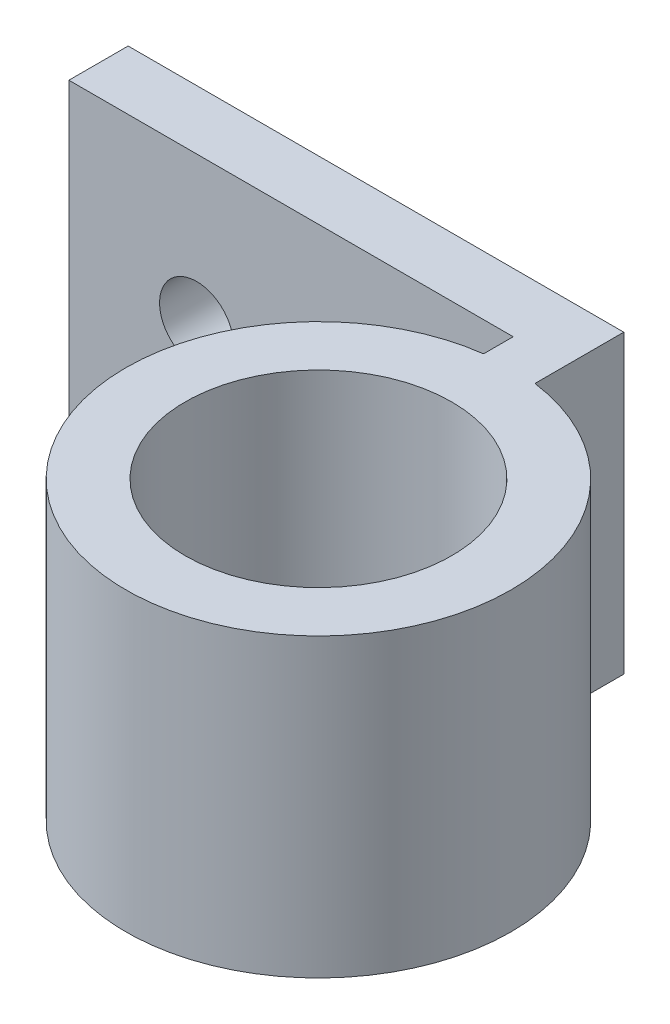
ISO-10303-21;
HEADER;
FILE_DESCRIPTION(('STEP AP214'),'2;1');
FILE_NAME('part.step','',(''),(''),'','','');
FILE_SCHEMA(('AUTOMOTIVE_DESIGN { 1 0 10303 214 1 1 1 1 }'));
ENDSEC;
DATA;
#1=APPLICATION_CONTEXT('core data for automotive mechanical design processes');
#2=APPLICATION_PROTOCOL_DEFINITION('international standard','automotive_design',2000,#1);
#3=PRODUCT_CONTEXT('',#1,'mechanical');
#4=PRODUCT('Part','Part','',(#3));
#5=PRODUCT_RELATED_PRODUCT_CATEGORY('part','',(#4));
#6=PRODUCT_DEFINITION_FORMATION('','',#4);
#7=PRODUCT_DEFINITION_CONTEXT('part definition',#1,'design');
#8=PRODUCT_DEFINITION('design','',#6,#7);
#9=PRODUCT_DEFINITION_SHAPE('','',#8);
#10=(LENGTH_UNIT() NAMED_UNIT(*) SI_UNIT(.MILLI.,.METRE.));
#11=(NAMED_UNIT(*) PLANE_ANGLE_UNIT() SI_UNIT($,.RADIAN.));
#12=(NAMED_UNIT(*) SI_UNIT($,.STERADIAN.) SOLID_ANGLE_UNIT());
#13=UNCERTAINTY_MEASURE_WITH_UNIT(LENGTH_MEASURE(1.E-05),#10,'distance_accuracy_value','');
#14=(GEOMETRIC_REPRESENTATION_CONTEXT(3) GLOBAL_UNCERTAINTY_ASSIGNED_CONTEXT((#13)) GLOBAL_UNIT_ASSIGNED_CONTEXT((#10,
#11,#12)) REPRESENTATION_CONTEXT('',''));
#15=CARTESIAN_POINT('',(0.,0.,0.));
#16=DIRECTION('',(0.,0.,1.));
#17=DIRECTION('',(1.,0.,0.));
#18=AXIS2_PLACEMENT_3D('',#15,#16,#17);
#19=CARTESIAN_POINT('',(0.,10.,0.));
#20=DIRECTION('',(0.,1.,0.));
#21=DIRECTION('',(0.,0.,1.));
#22=AXIS2_PLACEMENT_3D('',#19,#20,#21);
#23=PLANE('',#22);
#24=CARTESIAN_POINT('',(0.,10.,0.));
#25=DIRECTION('',(0.,1.,0.));
#26=DIRECTION('',(0.,0.,1.));
#27=AXIS2_PLACEMENT_3D('',#24,#25,#26);
#28=CIRCLE('',#27,6.5);
#29=CARTESIAN_POINT('',(-0.866666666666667,10.,-6.44196312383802));
#30=VERTEX_POINT('',#29);
#31=CARTESIAN_POINT('',(0.866666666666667,10.,-6.44196312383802));
#32=VERTEX_POINT('',#31);
#33=EDGE_CURVE('E129',#30,#32,#28,.T.);
#34=ORIENTED_EDGE('',*,*,#33,.T.);
#35=DIRECTION('',(0.,0.,-1.));
#36=VECTOR('',#35,1.);
#37=CARTESIAN_POINT('',(0.866666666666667,10.,-6.44196312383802));
#38=LINE('',#37,#36);
#39=CARTESIAN_POINT('',(0.866666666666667,10.,-9.44196312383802));
#40=VERTEX_POINT('',#39);
#41=EDGE_CURVE('E87',#32,#40,#38,.T.);
#42=ORIENTED_EDGE('',*,*,#41,.T.);
#43=DIRECTION('',(-1.,0.,0.));
#44=VECTOR('',#43,1.);
#45=CARTESIAN_POINT('',(-15.8666666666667,10.,-9.44196312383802));
#46=LINE('',#45,#44);
#47=CARTESIAN_POINT('',(-15.8666666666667,10.,-9.44196312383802));
#48=VERTEX_POINT('',#47);
#49=EDGE_CURVE('E100',#40,#48,#46,.T.);
#50=ORIENTED_EDGE('',*,*,#49,.T.);
#51=DIRECTION('',(0.,0.,1.));
#52=VECTOR('',#51,1.);
#53=CARTESIAN_POINT('',(-15.8666666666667,10.,-9.44196312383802));
#54=LINE('',#53,#52);
#55=CARTESIAN_POINT('',(-15.8666666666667,10.,-7.44196312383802));
#56=VERTEX_POINT('',#55);
#57=EDGE_CURVE('E94',#48,#56,#54,.T.);
#58=ORIENTED_EDGE('',*,*,#57,.T.);
#59=DIRECTION('',(1.,0.,0.));
#60=VECTOR('',#59,1.);
#61=CARTESIAN_POINT('',(-15.8666666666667,10.,-7.44196312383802));
#62=LINE('',#61,#60);
#63=CARTESIAN_POINT('',(-0.866666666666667,10.,-7.44196312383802));
#64=VERTEX_POINT('',#63);
#65=EDGE_CURVE('E98',#56,#64,#62,.T.);
#66=ORIENTED_EDGE('',*,*,#65,.T.);
#67=DIRECTION('',(0.,0.,1.));
#68=VECTOR('',#67,1.);
#69=CARTESIAN_POINT('',(-0.866666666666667,10.,-6.44196312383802));
#70=LINE('',#69,#68);
#71=EDGE_CURVE('E50',#64,#30,#70,.T.);
#72=ORIENTED_EDGE('',*,*,#71,.T.);
#73=EDGE_LOOP('',(#34,#42,#50,#58,#66,#72));
#74=FACE_BOUND('',#73,.T.);
#75=CARTESIAN_POINT('',(0.,10.,0.));
#76=DIRECTION('',(0.,1.,0.));
#77=DIRECTION('',(0.,0.,1.));
#78=AXIS2_PLACEMENT_3D('',#75,#76,#77);
#79=CIRCLE('',#78,4.5);
#80=CARTESIAN_POINT('',(0.,10.,4.5));
#81=VERTEX_POINT('',#80);
#82=EDGE_CURVE('E122',#81,#81,#79,.T.);
#83=ORIENTED_EDGE('',*,*,#82,.F.);
#84=EDGE_LOOP('',(#83));
#85=FACE_BOUND('',#84,.T.);
#86=ADVANCED_FACE('F33',(#74,#85),#23,.T.);
#87=CARTESIAN_POINT('',(0.,0.,0.));
#88=DIRECTION('',(0.,1.,0.));
#89=DIRECTION('',(0.,0.,1.));
#90=AXIS2_PLACEMENT_3D('',#87,#88,#89);
#91=PLANE('',#90);
#92=CARTESIAN_POINT('',(0.,0.,0.));
#93=DIRECTION('',(0.,1.,0.));
#94=DIRECTION('',(0.,0.,1.));
#95=AXIS2_PLACEMENT_3D('',#92,#93,#94);
#96=CIRCLE('',#95,6.5);
#97=CARTESIAN_POINT('',(-0.866666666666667,0.,-6.44196312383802));
#98=VERTEX_POINT('',#97);
#99=CARTESIAN_POINT('',(0.866666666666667,0.,-6.44196312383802));
#100=VERTEX_POINT('',#99);
#101=EDGE_CURVE('E118',#98,#100,#96,.T.);
#102=ORIENTED_EDGE('',*,*,#101,.F.);
#103=DIRECTION('',(0.,0.,1.));
#104=VECTOR('',#103,1.);
#105=CARTESIAN_POINT('',(-0.866666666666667,0.,-6.44196312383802));
#106=LINE('',#105,#104);
#107=CARTESIAN_POINT('',(-0.866666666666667,0.,-7.44196312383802));
#108=VERTEX_POINT('',#107);
#109=EDGE_CURVE('E79',#108,#98,#106,.T.);
#110=ORIENTED_EDGE('',*,*,#109,.F.);
#111=DIRECTION('',(1.,0.,0.));
#112=VECTOR('',#111,1.);
#113=CARTESIAN_POINT('',(-15.8666666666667,0.,-7.44196312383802));
#114=LINE('',#113,#112);
#115=CARTESIAN_POINT('',(-15.8666666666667,0.,-7.44196312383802));
#116=VERTEX_POINT('',#115);
#117=EDGE_CURVE('E73',#116,#108,#114,.T.);
#118=ORIENTED_EDGE('',*,*,#117,.F.);
#119=DIRECTION('',(0.,0.,1.));
#120=VECTOR('',#119,1.);
#121=CARTESIAN_POINT('',(-15.8666666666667,0.,-9.44196312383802));
#122=LINE('',#121,#120);
#123=CARTESIAN_POINT('',(-15.8666666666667,0.,-9.44196312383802));
#124=VERTEX_POINT('',#123);
#125=EDGE_CURVE('E108',#124,#116,#122,.T.);
#126=ORIENTED_EDGE('',*,*,#125,.F.);
#127=DIRECTION('',(-1.,0.,0.));
#128=VECTOR('',#127,1.);
#129=CARTESIAN_POINT('',(-15.8666666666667,0.,-9.44196312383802));
#130=LINE('',#129,#128);
#131=CARTESIAN_POINT('',(0.866666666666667,0.,-9.44196312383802));
#132=VERTEX_POINT('',#131);
#133=EDGE_CURVE('E124',#132,#124,#130,.T.);
#134=ORIENTED_EDGE('',*,*,#133,.F.);
#135=DIRECTION('',(0.,0.,-1.));
#136=VECTOR('',#135,1.);
#137=CARTESIAN_POINT('',(0.866666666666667,0.,-9.44196312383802));
#138=LINE('',#137,#136);
#139=EDGE_CURVE('E121',#100,#132,#138,.T.);
#140=ORIENTED_EDGE('',*,*,#139,.F.);
#141=EDGE_LOOP('',(#102,#110,#118,#126,#134,#140));
#142=FACE_BOUND('',#141,.T.);
#143=CARTESIAN_POINT('',(0.,0.,0.));
#144=DIRECTION('',(0.,1.,0.));
#145=DIRECTION('',(0.,0.,1.));
#146=AXIS2_PLACEMENT_3D('',#143,#144,#145);
#147=CIRCLE('',#146,4.5);
#148=CARTESIAN_POINT('',(0.,0.,4.5));
#149=VERTEX_POINT('',#148);
#150=EDGE_CURVE('E175',#149,#149,#147,.T.);
#151=ORIENTED_EDGE('',*,*,#150,.T.);
#152=EDGE_LOOP('',(#151));
#153=FACE_BOUND('',#152,.T.);
#154=ADVANCED_FACE('F138',(#142,#153),#91,.F.);
#155=CARTESIAN_POINT('',(0.,10.,0.));
#156=DIRECTION('',(0.,-1.,0.));
#157=DIRECTION('',(0.,0.,-1.));
#158=AXIS2_PLACEMENT_3D('',#155,#156,#157);
#159=CYLINDRICAL_SURFACE('',#158,6.5);
#160=ORIENTED_EDGE('',*,*,#101,.T.);
#161=DIRECTION('',(0.,-1.,0.));
#162=VECTOR('',#161,1.);
#163=CARTESIAN_POINT('',(0.866666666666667,10.,-6.44196312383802));
#164=LINE('',#163,#162);
#165=EDGE_CURVE('E11',#32,#100,#164,.T.);
#166=ORIENTED_EDGE('',*,*,#165,.F.);
#167=ORIENTED_EDGE('',*,*,#33,.F.);
#168=DIRECTION('',(0.,-1.,0.));
#169=VECTOR('',#168,1.);
#170=CARTESIAN_POINT('',(-0.866666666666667,10.,-6.44196312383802));
#171=LINE('',#170,#169);
#172=EDGE_CURVE('E114',#30,#98,#171,.T.);
#173=ORIENTED_EDGE('',*,*,#172,.T.);
#174=EDGE_LOOP('',(#160,#166,#167,#173));
#175=FACE_BOUND('',#174,.T.);
#176=ADVANCED_FACE('F35',(#175),#159,.T.);
#177=CARTESIAN_POINT('',(0.866666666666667,10.,-9.44196312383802));
#178=DIRECTION('',(-1.,0.,0.));
#179=DIRECTION('',(0.,0.,1.));
#180=AXIS2_PLACEMENT_3D('',#177,#178,#179);
#181=PLANE('',#180);
#182=ORIENTED_EDGE('',*,*,#139,.T.);
#183=DIRECTION('',(0.,-1.,0.));
#184=VECTOR('',#183,1.);
#185=CARTESIAN_POINT('',(0.866666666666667,10.,-9.44196312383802));
#186=LINE('',#185,#184);
#187=EDGE_CURVE('E42',#40,#132,#186,.T.);
#188=ORIENTED_EDGE('',*,*,#187,.F.);
#189=ORIENTED_EDGE('',*,*,#41,.F.);
#190=ORIENTED_EDGE('',*,*,#165,.T.);
#191=EDGE_LOOP('',(#182,#188,#189,#190));
#192=FACE_BOUND('',#191,.T.);
#193=ADVANCED_FACE('F188',(#192),#181,.F.);
#194=CARTESIAN_POINT('',(-15.8666666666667,10.,-9.44196312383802));
#195=DIRECTION('',(0.,0.,1.));
#196=DIRECTION('',(1.,0.,0.));
#197=AXIS2_PLACEMENT_3D('',#194,#195,#196);
#198=PLANE('',#197);
#199=CARTESIAN_POINT('',(-11.5555525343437,5.0227556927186,-9.44196312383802));
#200=DIRECTION('',(0.,0.,1.));
#201=DIRECTION('',(1.,0.,0.));
#202=AXIS2_PLACEMENT_3D('',#199,#200,#201);
#203=CIRCLE('',#202,1.25);
#204=CARTESIAN_POINT('',(-10.3055525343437,5.0227556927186,-9.44196312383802));
#205=VERTEX_POINT('',#204);
#206=EDGE_CURVE('E173',#205,#205,#203,.T.);
#207=ORIENTED_EDGE('',*,*,#206,.T.);
#208=EDGE_LOOP('',(#207));
#209=FACE_BOUND('',#208,.T.);
#210=ORIENTED_EDGE('',*,*,#133,.T.);
#211=DIRECTION('',(0.,-1.,0.));
#212=VECTOR('',#211,1.);
#213=CARTESIAN_POINT('',(-15.8666666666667,10.,-9.44196312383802));
#214=LINE('',#213,#212);
#215=EDGE_CURVE('E109',#48,#124,#214,.T.);
#216=ORIENTED_EDGE('',*,*,#215,.F.);
#217=ORIENTED_EDGE('',*,*,#49,.F.);
#218=ORIENTED_EDGE('',*,*,#187,.T.);
#219=EDGE_LOOP('',(#210,#216,#217,#218));
#220=FACE_BOUND('',#219,.T.);
#221=ADVANCED_FACE('F135',(#209,#220),#198,.F.);
#222=CARTESIAN_POINT('',(-15.8666666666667,10.,-9.44196312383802));
#223=DIRECTION('',(1.,0.,0.));
#224=DIRECTION('',(0.,0.,-1.));
#225=AXIS2_PLACEMENT_3D('',#222,#223,#224);
#226=PLANE('',#225);
#227=ORIENTED_EDGE('',*,*,#125,.T.);
#228=DIRECTION('',(0.,-1.,0.));
#229=VECTOR('',#228,1.);
#230=CARTESIAN_POINT('',(-15.8666666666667,10.,-7.44196312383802));
#231=LINE('',#230,#229);
#232=EDGE_CURVE('E105',#56,#116,#231,.T.);
#233=ORIENTED_EDGE('',*,*,#232,.F.);
#234=ORIENTED_EDGE('',*,*,#57,.F.);
#235=ORIENTED_EDGE('',*,*,#215,.T.);
#236=EDGE_LOOP('',(#227,#233,#234,#235));
#237=FACE_BOUND('',#236,.T.);
#238=ADVANCED_FACE('F106',(#237),#226,.F.);
#239=CARTESIAN_POINT('',(-15.8666666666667,10.,-7.44196312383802));
#240=DIRECTION('',(0.,0.,-1.));
#241=DIRECTION('',(-1.,0.,0.));
#242=AXIS2_PLACEMENT_3D('',#239,#240,#241);
#243=PLANE('',#242);
#244=CARTESIAN_POINT('',(-11.5555525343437,5.0227556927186,-7.44196312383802));
#245=DIRECTION('',(0.,0.,1.));
#246=DIRECTION('',(1.,0.,0.));
#247=AXIS2_PLACEMENT_3D('',#244,#245,#246);
#248=CIRCLE('',#247,1.25);
#249=CARTESIAN_POINT('',(-10.3055525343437,5.0227556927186,-7.44196312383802));
#250=VERTEX_POINT('',#249);
#251=EDGE_CURVE('E170',#250,#250,#248,.T.);
#252=ORIENTED_EDGE('',*,*,#251,.F.);
#253=EDGE_LOOP('',(#252));
#254=FACE_BOUND('',#253,.T.);
#255=ORIENTED_EDGE('',*,*,#117,.T.);
#256=DIRECTION('',(0.,-1.,0.));
#257=VECTOR('',#256,1.);
#258=CARTESIAN_POINT('',(-0.866666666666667,10.,-7.44196312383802));
#259=LINE('',#258,#257);
#260=EDGE_CURVE('E110',#64,#108,#259,.T.);
#261=ORIENTED_EDGE('',*,*,#260,.F.);
#262=ORIENTED_EDGE('',*,*,#65,.F.);
#263=ORIENTED_EDGE('',*,*,#232,.T.);
#264=EDGE_LOOP('',(#255,#261,#262,#263));
#265=FACE_BOUND('',#264,.T.);
#266=ADVANCED_FACE('F112',(#254,#265),#243,.F.);
#267=CARTESIAN_POINT('',(-0.866666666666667,10.,-6.44196312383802));
#268=DIRECTION('',(1.,0.,0.));
#269=DIRECTION('',(0.,0.,-1.));
#270=AXIS2_PLACEMENT_3D('',#267,#268,#269);
#271=PLANE('',#270);
#272=ORIENTED_EDGE('',*,*,#109,.T.);
#273=ORIENTED_EDGE('',*,*,#172,.F.);
#274=ORIENTED_EDGE('',*,*,#71,.F.);
#275=ORIENTED_EDGE('',*,*,#260,.T.);
#276=EDGE_LOOP('',(#272,#273,#274,#275));
#277=FACE_BOUND('',#276,.T.);
#278=ADVANCED_FACE('F143',(#277),#271,.F.);
#279=CARTESIAN_POINT('',(0.,10.,0.));
#280=DIRECTION('',(0.,-1.,0.));
#281=DIRECTION('',(0.,0.,-1.));
#282=AXIS2_PLACEMENT_3D('',#279,#280,#281);
#283=CYLINDRICAL_SURFACE('',#282,4.5);
#284=ORIENTED_EDGE('',*,*,#82,.T.);
#285=EDGE_LOOP('',(#284));
#286=FACE_BOUND('',#285,.T.);
#287=ORIENTED_EDGE('',*,*,#150,.F.);
#288=EDGE_LOOP('',(#287));
#289=FACE_BOUND('',#288,.T.);
#290=ADVANCED_FACE('F145',(#286,#289),#283,.F.);
#291=CARTESIAN_POINT('',(-11.5555525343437,5.0227556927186,-17.441963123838));
#292=DIRECTION('',(0.,0.,1.));
#293=DIRECTION('',(1.,0.,0.));
#294=AXIS2_PLACEMENT_3D('',#291,#292,#293);
#295=CYLINDRICAL_SURFACE('',#294,1.25);
#296=ORIENTED_EDGE('',*,*,#251,.T.);
#297=EDGE_LOOP('',(#296));
#298=FACE_BOUND('',#297,.T.);
#299=ORIENTED_EDGE('',*,*,#206,.F.);
#300=EDGE_LOOP('',(#299));
#301=FACE_BOUND('',#300,.T.);
#302=ADVANCED_FACE('F151',(#298,#301),#295,.F.);
#303=CLOSED_SHELL('',(#86,#154,#176,#193,#221,#238,#266,#278,#290,#302));
#304=MANIFOLD_SOLID_BREP('B2',#303);
#305=ADVANCED_BREP_SHAPE_REPRESENTATION('',(#18,#304),#14);
#306=SHAPE_DEFINITION_REPRESENTATION(#9,#305);
ENDSEC;
END-ISO-10303-21;
